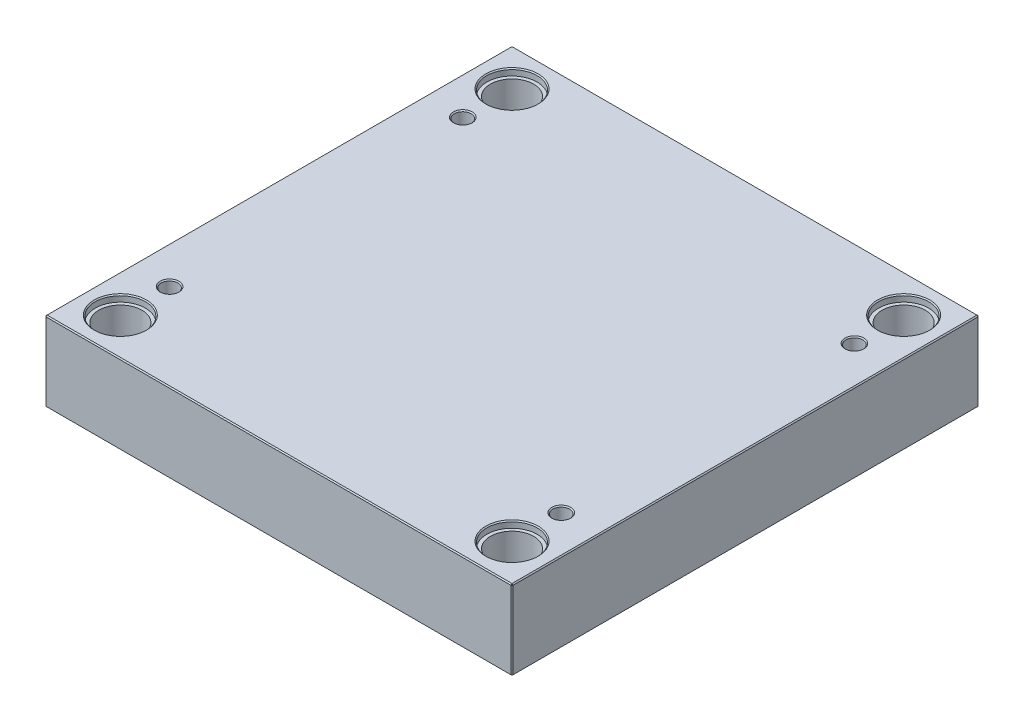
ISO-10303-21;
HEADER;
FILE_DESCRIPTION(('STEP AP214'),'2;1');
FILE_NAME('part.step','',(''),(''),'','','');
FILE_SCHEMA(('AUTOMOTIVE_DESIGN { 1 0 10303 214 1 1 1 1 }'));
ENDSEC;
DATA;
#1=APPLICATION_CONTEXT('core data for automotive mechanical design processes');
#2=APPLICATION_PROTOCOL_DEFINITION('international standard','automotive_design',2000,#1);
#3=PRODUCT_CONTEXT('',#1,'mechanical');
#4=PRODUCT('Part','Part','',(#3));
#5=PRODUCT_RELATED_PRODUCT_CATEGORY('part','',(#4));
#6=PRODUCT_DEFINITION_FORMATION('','',#4);
#7=PRODUCT_DEFINITION_CONTEXT('part definition',#1,'design');
#8=PRODUCT_DEFINITION('design','',#6,#7);
#9=PRODUCT_DEFINITION_SHAPE('','',#8);
#10=(LENGTH_UNIT() NAMED_UNIT(*) SI_UNIT(.MILLI.,.METRE.));
#11=(NAMED_UNIT(*) PLANE_ANGLE_UNIT() SI_UNIT($,.RADIAN.));
#12=(NAMED_UNIT(*) SI_UNIT($,.STERADIAN.) SOLID_ANGLE_UNIT());
#13=UNCERTAINTY_MEASURE_WITH_UNIT(LENGTH_MEASURE(1.E-05),#10,'distance_accuracy_value','');
#14=(GEOMETRIC_REPRESENTATION_CONTEXT(3) GLOBAL_UNCERTAINTY_ASSIGNED_CONTEXT((#13)) GLOBAL_UNIT_ASSIGNED_CONTEXT((#10,
#11,#12)) REPRESENTATION_CONTEXT('',''));
#15=CARTESIAN_POINT('',(0.,0.,0.));
#16=DIRECTION('',(0.,0.,1.));
#17=DIRECTION('',(1.,0.,0.));
#18=AXIS2_PLACEMENT_3D('',#15,#16,#17);
#19=CARTESIAN_POINT('',(-187.,0.,-187.));
#20=DIRECTION('',(0.,1.,0.));
#21=DIRECTION('',(0.,0.,1.));
#22=AXIS2_PLACEMENT_3D('',#19,#20,#21);
#23=CYLINDRICAL_SURFACE('',#22,20.65);
#24=CARTESIAN_POINT('',(-187.,0.999999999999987,-187.));
#25=DIRECTION('',(0.,1.,0.));
#26=DIRECTION('',(0.,0.,1.));
#27=AXIS2_PLACEMENT_3D('',#24,#25,#26);
#28=CIRCLE('',#27,20.65);
#29=CARTESIAN_POINT('',(-187.,0.999999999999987,-166.35));
#30=VERTEX_POINT('',#29);
#31=EDGE_CURVE('E471',#30,#30,#28,.F.);
#32=ORIENTED_EDGE('',*,*,#31,.T.);
#33=EDGE_LOOP('',(#32));
#34=FACE_BOUND('',#33,.T.);
#35=CARTESIAN_POINT('',(-187.,69.7,-187.));
#36=DIRECTION('',(0.,1.,0.));
#37=DIRECTION('',(0.,0.,1.));
#38=AXIS2_PLACEMENT_3D('',#35,#36,#37);
#39=CIRCLE('',#38,20.65);
#40=CARTESIAN_POINT('',(-187.,69.7,-166.35));
#41=VERTEX_POINT('',#40);
#42=EDGE_CURVE('E220',#41,#41,#39,.F.);
#43=ORIENTED_EDGE('',*,*,#42,.F.);
#44=EDGE_LOOP('',(#43));
#45=FACE_BOUND('',#44,.T.);
#46=ADVANCED_FACE('F15',(#34,#45),#23,.F.);
#47=CARTESIAN_POINT('',(187.,0.,-187.));
#48=DIRECTION('',(0.,1.,0.));
#49=DIRECTION('',(0.,0.,1.));
#50=AXIS2_PLACEMENT_3D('',#47,#48,#49);
#51=CYLINDRICAL_SURFACE('',#50,20.65);
#52=CARTESIAN_POINT('',(187.,0.999999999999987,-187.));
#53=DIRECTION('',(0.,1.,0.));
#54=DIRECTION('',(0.,0.,1.));
#55=AXIS2_PLACEMENT_3D('',#52,#53,#54);
#56=CIRCLE('',#55,20.65);
#57=CARTESIAN_POINT('',(187.,0.999999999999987,-166.35));
#58=VERTEX_POINT('',#57);
#59=EDGE_CURVE('E473',#58,#58,#56,.F.);
#60=ORIENTED_EDGE('',*,*,#59,.T.);
#61=EDGE_LOOP('',(#60));
#62=FACE_BOUND('',#61,.T.);
#63=CARTESIAN_POINT('',(187.,69.7,-187.));
#64=DIRECTION('',(0.,1.,0.));
#65=DIRECTION('',(0.,0.,1.));
#66=AXIS2_PLACEMENT_3D('',#63,#64,#65);
#67=CIRCLE('',#66,20.65);
#68=CARTESIAN_POINT('',(187.,69.7,-166.35));
#69=VERTEX_POINT('',#68);
#70=EDGE_CURVE('E217',#69,#69,#67,.F.);
#71=ORIENTED_EDGE('',*,*,#70,.F.);
#72=EDGE_LOOP('',(#71));
#73=FACE_BOUND('',#72,.T.);
#74=ADVANCED_FACE('F262',(#62,#73),#51,.F.);
#75=CARTESIAN_POINT('',(187.,0.,187.));
#76=DIRECTION('',(0.,1.,0.));
#77=DIRECTION('',(0.,0.,1.));
#78=AXIS2_PLACEMENT_3D('',#75,#76,#77);
#79=CYLINDRICAL_SURFACE('',#78,20.65);
#80=CARTESIAN_POINT('',(187.,0.999999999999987,187.));
#81=DIRECTION('',(0.,1.,0.));
#82=DIRECTION('',(0.,0.,1.));
#83=AXIS2_PLACEMENT_3D('',#80,#81,#82);
#84=CIRCLE('',#83,20.65);
#85=CARTESIAN_POINT('',(187.,0.999999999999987,207.65));
#86=VERTEX_POINT('',#85);
#87=EDGE_CURVE('E476',#86,#86,#84,.F.);
#88=ORIENTED_EDGE('',*,*,#87,.T.);
#89=EDGE_LOOP('',(#88));
#90=FACE_BOUND('',#89,.T.);
#91=CARTESIAN_POINT('',(187.,69.7,187.));
#92=DIRECTION('',(0.,1.,0.));
#93=DIRECTION('',(0.,0.,1.));
#94=AXIS2_PLACEMENT_3D('',#91,#92,#93);
#95=CIRCLE('',#94,20.65);
#96=CARTESIAN_POINT('',(187.,69.7,207.65));
#97=VERTEX_POINT('',#96);
#98=EDGE_CURVE('E213',#97,#97,#95,.F.);
#99=ORIENTED_EDGE('',*,*,#98,.F.);
#100=EDGE_LOOP('',(#99));
#101=FACE_BOUND('',#100,.T.);
#102=ADVANCED_FACE('F269',(#90,#101),#79,.F.);
#103=CARTESIAN_POINT('',(-187.,0.,187.));
#104=DIRECTION('',(0.,1.,0.));
#105=DIRECTION('',(0.,0.,1.));
#106=AXIS2_PLACEMENT_3D('',#103,#104,#105);
#107=CYLINDRICAL_SURFACE('',#106,20.65);
#108=CARTESIAN_POINT('',(-187.,0.999999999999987,187.));
#109=DIRECTION('',(0.,1.,0.));
#110=DIRECTION('',(0.,0.,1.));
#111=AXIS2_PLACEMENT_3D('',#108,#109,#110);
#112=CIRCLE('',#111,20.65);
#113=CARTESIAN_POINT('',(-187.,0.999999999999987,207.65));
#114=VERTEX_POINT('',#113);
#115=EDGE_CURVE('E479',#114,#114,#112,.F.);
#116=ORIENTED_EDGE('',*,*,#115,.T.);
#117=EDGE_LOOP('',(#116));
#118=FACE_BOUND('',#117,.T.);
#119=CARTESIAN_POINT('',(-187.,69.7,187.));
#120=DIRECTION('',(0.,1.,0.));
#121=DIRECTION('',(0.,0.,1.));
#122=AXIS2_PLACEMENT_3D('',#119,#120,#121);
#123=CIRCLE('',#122,20.65);
#124=CARTESIAN_POINT('',(-187.,69.7,207.65));
#125=VERTEX_POINT('',#124);
#126=EDGE_CURVE('E210',#125,#125,#123,.F.);
#127=ORIENTED_EDGE('',*,*,#126,.F.);
#128=EDGE_LOOP('',(#127));
#129=FACE_BOUND('',#128,.T.);
#130=ADVANCED_FACE('F276',(#118,#129),#107,.F.);
#131=CARTESIAN_POINT('',(-223.,76.,223.));
#132=DIRECTION('',(1.,0.,0.));
#133=DIRECTION('',(0.,0.,-1.));
#134=AXIS2_PLACEMENT_3D('',#131,#132,#133);
#135=PLANE('',#134);
#136=DIRECTION('',(0.,-1.,0.));
#137=VECTOR('',#136,1.);
#138=CARTESIAN_POINT('',(-223.,76.,-222.));
#139=LINE('',#138,#137);
#140=CARTESIAN_POINT('',(-223.,75.,-222.));
#141=VERTEX_POINT('',#140);
#142=CARTESIAN_POINT('',(-223.,1.,-222.));
#143=VERTEX_POINT('',#142);
#144=EDGE_CURVE('E486',#141,#143,#139,.T.);
#145=ORIENTED_EDGE('',*,*,#144,.T.);
#146=DIRECTION('',(0.,0.,1.));
#147=VECTOR('',#146,1.);
#148=CARTESIAN_POINT('',(-223.,1.,223.));
#149=LINE('',#148,#147);
#150=CARTESIAN_POINT('',(-223.,1.,222.));
#151=VERTEX_POINT('',#150);
#152=EDGE_CURVE('E489',#143,#151,#149,.T.);
#153=ORIENTED_EDGE('',*,*,#152,.T.);
#154=DIRECTION('',(0.,1.,0.));
#155=VECTOR('',#154,1.);
#156=CARTESIAN_POINT('',(-223.,76.,222.));
#157=LINE('',#156,#155);
#158=CARTESIAN_POINT('',(-223.,75.,222.));
#159=VERTEX_POINT('',#158);
#160=EDGE_CURVE('E484',#151,#159,#157,.T.);
#161=ORIENTED_EDGE('',*,*,#160,.T.);
#162=DIRECTION('',(0.,0.,-1.));
#163=VECTOR('',#162,1.);
#164=CARTESIAN_POINT('',(-223.,75.,-223.));
#165=LINE('',#164,#163);
#166=EDGE_CURVE('E482',#159,#141,#165,.T.);
#167=ORIENTED_EDGE('',*,*,#166,.T.);
#168=EDGE_LOOP('',(#145,#153,#161,#167));
#169=FACE_BOUND('',#168,.T.);
#170=ADVANCED_FACE('F297',(#169),#135,.F.);
#171=CARTESIAN_POINT('',(223.,76.,223.));
#172=DIRECTION('',(0.,0.,-1.));
#173=DIRECTION('',(-1.,0.,0.));
#174=AXIS2_PLACEMENT_3D('',#171,#172,#173);
#175=PLANE('',#174);
#176=DIRECTION('',(-1.,0.,0.));
#177=VECTOR('',#176,1.);
#178=CARTESIAN_POINT('',(-223.,75.,223.));
#179=LINE('',#178,#177);
#180=CARTESIAN_POINT('',(222.,75.,223.));
#181=VERTEX_POINT('',#180);
#182=CARTESIAN_POINT('',(-222.,75.,223.));
#183=VERTEX_POINT('',#182);
#184=EDGE_CURVE('E508',#181,#183,#179,.T.);
#185=ORIENTED_EDGE('',*,*,#184,.T.);
#186=DIRECTION('',(0.,-1.,0.));
#187=VECTOR('',#186,1.);
#188=CARTESIAN_POINT('',(-222.,76.,223.));
#189=LINE('',#188,#187);
#190=CARTESIAN_POINT('',(-222.,1.00000000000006,223.));
#191=VERTEX_POINT('',#190);
#192=EDGE_CURVE('E514',#183,#191,#189,.T.);
#193=ORIENTED_EDGE('',*,*,#192,.T.);
#194=DIRECTION('',(1.,0.,0.));
#195=VECTOR('',#194,1.);
#196=CARTESIAN_POINT('',(223.,1.00000000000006,223.));
#197=LINE('',#196,#195);
#198=CARTESIAN_POINT('',(222.,1.00000000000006,223.));
#199=VERTEX_POINT('',#198);
#200=EDGE_CURVE('E512',#191,#199,#197,.T.);
#201=ORIENTED_EDGE('',*,*,#200,.T.);
#202=DIRECTION('',(0.,1.,0.));
#203=VECTOR('',#202,1.);
#204=CARTESIAN_POINT('',(222.,76.,223.));
#205=LINE('',#204,#203);
#206=EDGE_CURVE('E510',#199,#181,#205,.T.);
#207=ORIENTED_EDGE('',*,*,#206,.T.);
#208=EDGE_LOOP('',(#185,#193,#201,#207));
#209=FACE_BOUND('',#208,.T.);
#210=ADVANCED_FACE('F293',(#209),#175,.F.);
#211=CARTESIAN_POINT('',(223.,76.,223.));
#212=DIRECTION('',(-1.,0.,0.));
#213=DIRECTION('',(0.,0.,1.));
#214=AXIS2_PLACEMENT_3D('',#211,#212,#213);
#215=PLANE('',#214);
#216=DIRECTION('',(0.,0.,-1.));
#217=VECTOR('',#216,1.);
#218=CARTESIAN_POINT('',(223.,1.00000000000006,223.));
#219=LINE('',#218,#217);
#220=CARTESIAN_POINT('',(223.,1.00000000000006,222.));
#221=VERTEX_POINT('',#220);
#222=CARTESIAN_POINT('',(223.,1.00000000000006,-222.));
#223=VERTEX_POINT('',#222);
#224=EDGE_CURVE('E503',#221,#223,#219,.T.);
#225=ORIENTED_EDGE('',*,*,#224,.T.);
#226=DIRECTION('',(0.,1.,0.));
#227=VECTOR('',#226,1.);
#228=CARTESIAN_POINT('',(223.,76.,-222.));
#229=LINE('',#228,#227);
#230=CARTESIAN_POINT('',(223.,75.,-222.));
#231=VERTEX_POINT('',#230);
#232=EDGE_CURVE('E505',#223,#231,#229,.T.);
#233=ORIENTED_EDGE('',*,*,#232,.T.);
#234=DIRECTION('',(0.,0.,1.));
#235=VECTOR('',#234,1.);
#236=CARTESIAN_POINT('',(223.,75.,223.));
#237=LINE('',#236,#235);
#238=CARTESIAN_POINT('',(223.,75.,222.));
#239=VERTEX_POINT('',#238);
#240=EDGE_CURVE('E499',#231,#239,#237,.T.);
#241=ORIENTED_EDGE('',*,*,#240,.T.);
#242=DIRECTION('',(0.,-1.,0.));
#243=VECTOR('',#242,1.);
#244=CARTESIAN_POINT('',(223.,76.,222.));
#245=LINE('',#244,#243);
#246=EDGE_CURVE('E501',#239,#221,#245,.T.);
#247=ORIENTED_EDGE('',*,*,#246,.T.);
#248=EDGE_LOOP('',(#225,#233,#241,#247));
#249=FACE_BOUND('',#248,.T.);
#250=ADVANCED_FACE('F289',(#249),#215,.F.);
#251=CARTESIAN_POINT('',(223.,76.,-223.));
#252=DIRECTION('',(0.,0.,1.));
#253=DIRECTION('',(1.,0.,0.));
#254=AXIS2_PLACEMENT_3D('',#251,#252,#253);
#255=PLANE('',#254);
#256=DIRECTION('',(0.,-1.,0.));
#257=VECTOR('',#256,1.);
#258=CARTESIAN_POINT('',(222.,76.,-223.));
#259=LINE('',#258,#257);
#260=CARTESIAN_POINT('',(222.,75.,-223.));
#261=VERTEX_POINT('',#260);
#262=CARTESIAN_POINT('',(222.,1.00000000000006,-223.));
#263=VERTEX_POINT('',#262);
#264=EDGE_CURVE('E493',#261,#263,#259,.T.);
#265=ORIENTED_EDGE('',*,*,#264,.T.);
#266=DIRECTION('',(-1.,0.,0.));
#267=VECTOR('',#266,1.);
#268=CARTESIAN_POINT('',(223.,1.00000000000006,-223.));
#269=LINE('',#268,#267);
#270=CARTESIAN_POINT('',(-222.,1.00000000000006,-223.));
#271=VERTEX_POINT('',#270);
#272=EDGE_CURVE('E137',#263,#271,#269,.T.);
#273=ORIENTED_EDGE('',*,*,#272,.T.);
#274=DIRECTION('',(0.,1.,0.));
#275=VECTOR('',#274,1.);
#276=CARTESIAN_POINT('',(-222.,76.,-223.));
#277=LINE('',#276,#275);
#278=CARTESIAN_POINT('',(-222.,75.,-223.));
#279=VERTEX_POINT('',#278);
#280=EDGE_CURVE('E495',#271,#279,#277,.T.);
#281=ORIENTED_EDGE('',*,*,#280,.T.);
#282=DIRECTION('',(1.,0.,0.));
#283=VECTOR('',#282,1.);
#284=CARTESIAN_POINT('',(223.,75.,-223.));
#285=LINE('',#284,#283);
#286=EDGE_CURVE('E491',#279,#261,#285,.T.);
#287=ORIENTED_EDGE('',*,*,#286,.T.);
#288=EDGE_LOOP('',(#265,#273,#281,#287));
#289=FACE_BOUND('',#288,.T.);
#290=ADVANCED_FACE('F281',(#289),#255,.F.);
#291=CARTESIAN_POINT('',(0.,76.,0.));
#292=DIRECTION('',(0.,1.,0.));
#293=DIRECTION('',(0.,0.,1.));
#294=AXIS2_PLACEMENT_3D('',#291,#292,#293);
#295=PLANE('',#294);
#296=CARTESIAN_POINT('',(187.,76.,187.));
#297=DIRECTION('',(0.,1.,0.));
#298=DIRECTION('',(0.,0.,1.));
#299=AXIS2_PLACEMENT_3D('',#296,#297,#298);
#300=CIRCLE('',#299,25.);
#301=CARTESIAN_POINT('',(187.,76.,212.));
#302=VERTEX_POINT('',#301);
#303=EDGE_CURVE('E235',#302,#302,#300,.F.);
#304=ORIENTED_EDGE('',*,*,#303,.T.);
#305=EDGE_LOOP('',(#304));
#306=FACE_BOUND('',#305,.T.);
#307=CARTESIAN_POINT('',(-187.,76.,187.));
#308=DIRECTION('',(0.,1.,0.));
#309=DIRECTION('',(0.,0.,1.));
#310=AXIS2_PLACEMENT_3D('',#307,#308,#309);
#311=CIRCLE('',#310,25.);
#312=CARTESIAN_POINT('',(-187.,76.,212.));
#313=VERTEX_POINT('',#312);
#314=EDGE_CURVE('E232',#313,#313,#311,.F.);
#315=ORIENTED_EDGE('',*,*,#314,.T.);
#316=EDGE_LOOP('',(#315));
#317=FACE_BOUND('',#316,.T.);
#318=CARTESIAN_POINT('',(187.,76.,-187.));
#319=DIRECTION('',(0.,1.,0.));
#320=DIRECTION('',(0.,0.,1.));
#321=AXIS2_PLACEMENT_3D('',#318,#319,#320);
#322=CIRCLE('',#321,25.);
#323=CARTESIAN_POINT('',(187.,76.,-162.));
#324=VERTEX_POINT('',#323);
#325=EDGE_CURVE('E229',#324,#324,#322,.F.);
#326=ORIENTED_EDGE('',*,*,#325,.T.);
#327=EDGE_LOOP('',(#326));
#328=FACE_BOUND('',#327,.T.);
#329=CARTESIAN_POINT('',(-187.,76.,-187.));
#330=DIRECTION('',(0.,1.,0.));
#331=DIRECTION('',(0.,0.,1.));
#332=AXIS2_PLACEMENT_3D('',#329,#330,#331);
#333=CIRCLE('',#332,25.);
#334=CARTESIAN_POINT('',(-187.,76.,-162.));
#335=VERTEX_POINT('',#334);
#336=EDGE_CURVE('E226',#335,#335,#333,.F.);
#337=ORIENTED_EDGE('',*,*,#336,.T.);
#338=EDGE_LOOP('',(#337));
#339=FACE_BOUND('',#338,.T.);
#340=CARTESIAN_POINT('',(-187.,76.,140.));
#341=DIRECTION('',(0.,1.,0.));
#342=DIRECTION('',(0.,0.,1.));
#343=AXIS2_PLACEMENT_3D('',#340,#341,#342);
#344=CIRCLE('',#343,8.9999999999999);
#345=CARTESIAN_POINT('',(-187.,76.,149.));
#346=VERTEX_POINT('',#345);
#347=EDGE_CURVE('E197',#346,#346,#344,.F.);
#348=ORIENTED_EDGE('',*,*,#347,.T.);
#349=EDGE_LOOP('',(#348));
#350=FACE_BOUND('',#349,.T.);
#351=CARTESIAN_POINT('',(187.,76.,140.));
#352=DIRECTION('',(0.,1.,0.));
#353=DIRECTION('',(0.,0.,1.));
#354=AXIS2_PLACEMENT_3D('',#351,#352,#353);
#355=CIRCLE('',#354,9.00000000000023);
#356=CARTESIAN_POINT('',(187.,76.,149.));
#357=VERTEX_POINT('',#356);
#358=EDGE_CURVE('E194',#357,#357,#355,.F.);
#359=ORIENTED_EDGE('',*,*,#358,.T.);
#360=EDGE_LOOP('',(#359));
#361=FACE_BOUND('',#360,.T.);
#362=CARTESIAN_POINT('',(187.,76.,-140.));
#363=DIRECTION('',(0.,1.,0.));
#364=DIRECTION('',(0.,0.,1.));
#365=AXIS2_PLACEMENT_3D('',#362,#363,#364);
#366=CIRCLE('',#365,9.);
#367=CARTESIAN_POINT('',(187.,76.,-131.));
#368=VERTEX_POINT('',#367);
#369=EDGE_CURVE('E191',#368,#368,#366,.F.);
#370=ORIENTED_EDGE('',*,*,#369,.T.);
#371=EDGE_LOOP('',(#370));
#372=FACE_BOUND('',#371,.T.);
#373=CARTESIAN_POINT('',(-187.,76.,-140.));
#374=DIRECTION('',(0.,1.,0.));
#375=DIRECTION('',(0.,0.,1.));
#376=AXIS2_PLACEMENT_3D('',#373,#374,#375);
#377=CIRCLE('',#376,8.9999999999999);
#378=CARTESIAN_POINT('',(-187.,76.,-131.));
#379=VERTEX_POINT('',#378);
#380=EDGE_CURVE('E187',#379,#379,#377,.F.);
#381=ORIENTED_EDGE('',*,*,#380,.T.);
#382=EDGE_LOOP('',(#381));
#383=FACE_BOUND('',#382,.T.);
#384=DIRECTION('',(0.,0.,-1.));
#385=VECTOR('',#384,1.);
#386=CARTESIAN_POINT('',(222.,76.,-223.));
#387=LINE('',#386,#385);
#388=CARTESIAN_POINT('',(222.,76.,222.));
#389=VERTEX_POINT('',#388);
#390=CARTESIAN_POINT('',(222.,76.,-222.));
#391=VERTEX_POINT('',#390);
#392=EDGE_CURVE('E30',#389,#391,#387,.T.);
#393=ORIENTED_EDGE('',*,*,#392,.T.);
#394=DIRECTION('',(-1.,0.,0.));
#395=VECTOR('',#394,1.);
#396=CARTESIAN_POINT('',(-223.,76.,-222.));
#397=LINE('',#396,#395);
#398=CARTESIAN_POINT('',(-222.,76.,-222.));
#399=VERTEX_POINT('',#398);
#400=EDGE_CURVE('E188',#391,#399,#397,.T.);
#401=ORIENTED_EDGE('',*,*,#400,.T.);
#402=DIRECTION('',(0.,0.,1.));
#403=VECTOR('',#402,1.);
#404=CARTESIAN_POINT('',(-222.,76.,223.));
#405=LINE('',#404,#403);
#406=CARTESIAN_POINT('',(-222.,76.,222.));
#407=VERTEX_POINT('',#406);
#408=EDGE_CURVE('E517',#399,#407,#405,.T.);
#409=ORIENTED_EDGE('',*,*,#408,.T.);
#410=DIRECTION('',(1.,0.,0.));
#411=VECTOR('',#410,1.);
#412=CARTESIAN_POINT('',(223.,76.,222.));
#413=LINE('',#412,#411);
#414=EDGE_CURVE('E35',#407,#389,#413,.T.);
#415=ORIENTED_EDGE('',*,*,#414,.T.);
#416=EDGE_LOOP('',(#393,#401,#409,#415));
#417=FACE_BOUND('',#416,.T.);
#418=ADVANCED_FACE('F278',(#306,#317,#328,#339,#350,#361,#372,#383,#417),#295,.T.);
#419=CARTESIAN_POINT('',(0.,0.,0.));
#420=DIRECTION('',(0.,1.,0.));
#421=DIRECTION('',(0.,0.,1.));
#422=AXIS2_PLACEMENT_3D('',#419,#420,#421);
#423=PLANE('',#422);
#424=CARTESIAN_POINT('',(-187.,0.,-187.));
#425=DIRECTION('',(0.,1.,0.));
#426=DIRECTION('',(0.,0.,1.));
#427=AXIS2_PLACEMENT_3D('',#424,#425,#426);
#428=CIRCLE('',#427,21.65);
#429=CARTESIAN_POINT('',(-187.,0.,-165.35));
#430=VERTEX_POINT('',#429);
#431=EDGE_CURVE('E468',#430,#430,#428,.T.);
#432=ORIENTED_EDGE('',*,*,#431,.T.);
#433=EDGE_LOOP('',(#432));
#434=FACE_BOUND('',#433,.T.);
#435=CARTESIAN_POINT('',(187.,0.,-187.));
#436=DIRECTION('',(0.,1.,0.));
#437=DIRECTION('',(0.,0.,1.));
#438=AXIS2_PLACEMENT_3D('',#435,#436,#437);
#439=CIRCLE('',#438,21.65);
#440=CARTESIAN_POINT('',(187.,0.,-165.35));
#441=VERTEX_POINT('',#440);
#442=EDGE_CURVE('E465',#441,#441,#439,.T.);
#443=ORIENTED_EDGE('',*,*,#442,.T.);
#444=EDGE_LOOP('',(#443));
#445=FACE_BOUND('',#444,.T.);
#446=CARTESIAN_POINT('',(187.,0.,187.));
#447=DIRECTION('',(0.,1.,0.));
#448=DIRECTION('',(0.,0.,1.));
#449=AXIS2_PLACEMENT_3D('',#446,#447,#448);
#450=CIRCLE('',#449,21.65);
#451=CARTESIAN_POINT('',(187.,0.,208.65));
#452=VERTEX_POINT('',#451);
#453=EDGE_CURVE('E462',#452,#452,#450,.T.);
#454=ORIENTED_EDGE('',*,*,#453,.T.);
#455=EDGE_LOOP('',(#454));
#456=FACE_BOUND('',#455,.T.);
#457=CARTESIAN_POINT('',(-187.,0.,187.));
#458=DIRECTION('',(0.,1.,0.));
#459=DIRECTION('',(0.,0.,1.));
#460=AXIS2_PLACEMENT_3D('',#457,#458,#459);
#461=CIRCLE('',#460,21.65);
#462=CARTESIAN_POINT('',(-187.,0.,208.65));
#463=VERTEX_POINT('',#462);
#464=EDGE_CURVE('E459',#463,#463,#461,.T.);
#465=ORIENTED_EDGE('',*,*,#464,.T.);
#466=EDGE_LOOP('',(#465));
#467=FACE_BOUND('',#466,.T.);
#468=DIRECTION('',(0.,0.,1.));
#469=VECTOR('',#468,1.);
#470=CARTESIAN_POINT('',(222.,0.,0.));
#471=LINE('',#470,#469);
#472=CARTESIAN_POINT('',(222.,0.,-222.));
#473=VERTEX_POINT('',#472);
#474=CARTESIAN_POINT('',(222.,0.,222.));
#475=VERTEX_POINT('',#474);
#476=EDGE_CURVE('E107',#473,#475,#471,.T.);
#477=ORIENTED_EDGE('',*,*,#476,.T.);
#478=DIRECTION('',(-1.,0.,0.));
#479=VECTOR('',#478,1.);
#480=CARTESIAN_POINT('',(0.,0.,222.));
#481=LINE('',#480,#479);
#482=CARTESIAN_POINT('',(-222.,0.,222.));
#483=VERTEX_POINT('',#482);
#484=EDGE_CURVE('E457',#475,#483,#481,.T.);
#485=ORIENTED_EDGE('',*,*,#484,.T.);
#486=DIRECTION('',(0.,0.,-1.));
#487=VECTOR('',#486,1.);
#488=CARTESIAN_POINT('',(-222.,0.,0.));
#489=LINE('',#488,#487);
#490=CARTESIAN_POINT('',(-222.,0.,-222.));
#491=VERTEX_POINT('',#490);
#492=EDGE_CURVE('E109',#483,#491,#489,.T.);
#493=ORIENTED_EDGE('',*,*,#492,.T.);
#494=DIRECTION('',(1.,0.,0.));
#495=VECTOR('',#494,1.);
#496=CARTESIAN_POINT('',(0.,0.,-222.));
#497=LINE('',#496,#495);
#498=EDGE_CURVE('E103',#491,#473,#497,.T.);
#499=ORIENTED_EDGE('',*,*,#498,.T.);
#500=EDGE_LOOP('',(#477,#485,#493,#499));
#501=FACE_BOUND('',#500,.T.);
#502=ADVANCED_FACE('F105',(#434,#445,#456,#467,#501),#423,.F.);
#503=CARTESIAN_POINT('',(-187.,0.,-187.));
#504=DIRECTION('',(0.,-1.,0.));
#505=DIRECTION('',(0.,0.,-1.));
#506=AXIS2_PLACEMENT_3D('',#503,#504,#505);
#507=CONICAL_SURFACE('',#506,21.65,0.785398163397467);
#508=ORIENTED_EDGE('',*,*,#31,.F.);
#509=EDGE_LOOP('',(#508));
#510=FACE_BOUND('',#509,.T.);
#511=ORIENTED_EDGE('',*,*,#431,.F.);
#512=EDGE_LOOP('',(#511));
#513=FACE_BOUND('',#512,.T.);
#514=ADVANCED_FACE('F285',(#510,#513),#507,.F.);
#515=CARTESIAN_POINT('',(187.,0.,-187.));
#516=DIRECTION('',(0.,-1.,0.));
#517=DIRECTION('',(0.,0.,-1.));
#518=AXIS2_PLACEMENT_3D('',#515,#516,#517);
#519=CONICAL_SURFACE('',#518,21.65,0.785398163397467);
#520=ORIENTED_EDGE('',*,*,#59,.F.);
#521=EDGE_LOOP('',(#520));
#522=FACE_BOUND('',#521,.T.);
#523=ORIENTED_EDGE('',*,*,#442,.F.);
#524=EDGE_LOOP('',(#523));
#525=FACE_BOUND('',#524,.T.);
#526=ADVANCED_FACE('F304',(#522,#525),#519,.F.);
#527=CARTESIAN_POINT('',(187.,0.,187.));
#528=DIRECTION('',(0.,-1.,0.));
#529=DIRECTION('',(0.,0.,-1.));
#530=AXIS2_PLACEMENT_3D('',#527,#528,#529);
#531=CONICAL_SURFACE('',#530,21.65,0.785398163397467);
#532=ORIENTED_EDGE('',*,*,#87,.F.);
#533=EDGE_LOOP('',(#532));
#534=FACE_BOUND('',#533,.T.);
#535=ORIENTED_EDGE('',*,*,#453,.F.);
#536=EDGE_LOOP('',(#535));
#537=FACE_BOUND('',#536,.T.);
#538=ADVANCED_FACE('F308',(#534,#537),#531,.F.);
#539=CARTESIAN_POINT('',(-187.,0.,187.));
#540=DIRECTION('',(0.,-1.,0.));
#541=DIRECTION('',(0.,0.,-1.));
#542=AXIS2_PLACEMENT_3D('',#539,#540,#541);
#543=CONICAL_SURFACE('',#542,21.65,0.785398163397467);
#544=ORIENTED_EDGE('',*,*,#115,.F.);
#545=EDGE_LOOP('',(#544));
#546=FACE_BOUND('',#545,.T.);
#547=ORIENTED_EDGE('',*,*,#464,.F.);
#548=EDGE_LOOP('',(#547));
#549=FACE_BOUND('',#548,.T.);
#550=ADVANCED_FACE('F312',(#546,#549),#543,.F.);
#551=CARTESIAN_POINT('',(223.,76.,222.));
#552=DIRECTION('',(-0.707106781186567,0.,-0.707106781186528));
#553=DIRECTION('',(0.,-1.,0.));
#554=AXIS2_PLACEMENT_3D('',#551,#552,#553);
#555=PLANE('',#554);
#556=DIRECTION('',(-0.707106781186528,0.,0.707106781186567));
#557=VECTOR('',#556,1.);
#558=CARTESIAN_POINT('',(222.,75.,223.));
#559=LINE('',#558,#557);
#560=EDGE_CURVE('E125',#181,#239,#559,.F.);
#561=ORIENTED_EDGE('',*,*,#560,.F.);
#562=ORIENTED_EDGE('',*,*,#206,.F.);
#563=DIRECTION('',(0.707106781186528,0.,-0.707106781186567));
#564=VECTOR('',#563,1.);
#565=CARTESIAN_POINT('',(222.,1.00000000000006,223.));
#566=LINE('',#565,#564);
#567=EDGE_CURVE('E179',#221,#199,#566,.F.);
#568=ORIENTED_EDGE('',*,*,#567,.F.);
#569=ORIENTED_EDGE('',*,*,#246,.F.);
#570=EDGE_LOOP('',(#561,#562,#568,#569));
#571=FACE_BOUND('',#570,.T.);
#572=ADVANCED_FACE('F316',(#571),#555,.F.);
#573=CARTESIAN_POINT('',(222.,75.,223.));
#574=DIRECTION('',(0.577350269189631,0.577350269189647,0.577350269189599));
#575=DIRECTION('',(-0.707106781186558,0.707106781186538,0.));
#576=AXIS2_PLACEMENT_3D('',#573,#574,#575);
#577=PLANE('',#576);
#578=DIRECTION('',(0.,-0.707106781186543,0.707106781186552));
#579=VECTOR('',#578,1.);
#580=CARTESIAN_POINT('',(222.,75.,223.));
#581=LINE('',#580,#579);
#582=EDGE_CURVE('E174',#181,#389,#581,.F.);
#583=ORIENTED_EDGE('',*,*,#582,.F.);
#584=ORIENTED_EDGE('',*,*,#560,.T.);
#585=DIRECTION('',(-0.707106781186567,0.707106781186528,0.));
#586=VECTOR('',#585,1.);
#587=CARTESIAN_POINT('',(222.5,75.5,222.));
#588=LINE('',#587,#586);
#589=EDGE_CURVE('E176',#389,#239,#588,.F.);
#590=ORIENTED_EDGE('',*,*,#589,.F.);
#591=EDGE_LOOP('',(#583,#584,#590));
#592=FACE_BOUND('',#591,.T.);
#593=ADVANCED_FACE('F384',(#592),#577,.T.);
#594=CARTESIAN_POINT('',(222.,1.00000000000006,223.));
#595=DIRECTION('',(0.577350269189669,-0.577350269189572,0.577350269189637));
#596=DIRECTION('',(0.707106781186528,0.,-0.707106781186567));
#597=AXIS2_PLACEMENT_3D('',#594,#595,#596);
#598=PLANE('',#597);
#599=DIRECTION('',(-0.707106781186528,-0.707106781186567,0.));
#600=VECTOR('',#599,1.);
#601=CARTESIAN_POINT('',(222.5,0.5,222.));
#602=LINE('',#601,#600);
#603=EDGE_CURVE('E123',#221,#475,#602,.T.);
#604=ORIENTED_EDGE('',*,*,#603,.F.);
#605=ORIENTED_EDGE('',*,*,#567,.T.);
#606=DIRECTION('',(0.,0.707106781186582,0.707106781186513));
#607=VECTOR('',#606,1.);
#608=CARTESIAN_POINT('',(222.,1.00000000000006,223.));
#609=LINE('',#608,#607);
#610=EDGE_CURVE('E171',#475,#199,#609,.T.);
#611=ORIENTED_EDGE('',*,*,#610,.F.);
#612=EDGE_LOOP('',(#604,#605,#611));
#613=FACE_BOUND('',#612,.T.);
#614=ADVANCED_FACE('F380',(#613),#598,.T.);
#615=CARTESIAN_POINT('',(222.,76.,0.));
#616=DIRECTION('',(0.707106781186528,0.707106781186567,0.));
#617=DIRECTION('',(0.,0.,1.));
#618=AXIS2_PLACEMENT_3D('',#615,#616,#617);
#619=PLANE('',#618);
#620=ORIENTED_EDGE('',*,*,#589,.T.);
#621=ORIENTED_EDGE('',*,*,#240,.F.);
#622=DIRECTION('',(0.707106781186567,-0.707106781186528,0.));
#623=VECTOR('',#622,1.);
#624=CARTESIAN_POINT('',(223.,75.,-222.));
#625=LINE('',#624,#623);
#626=EDGE_CURVE('E165',#391,#231,#625,.T.);
#627=ORIENTED_EDGE('',*,*,#626,.F.);
#628=ORIENTED_EDGE('',*,*,#392,.F.);
#629=EDGE_LOOP('',(#620,#621,#627,#628));
#630=FACE_BOUND('',#629,.T.);
#631=ADVANCED_FACE('F376',(#630),#619,.T.);
#632=CARTESIAN_POINT('',(0.,76.,222.));
#633=DIRECTION('',(0.,0.707106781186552,0.707106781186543));
#634=DIRECTION('',(-1.,0.,0.));
#635=AXIS2_PLACEMENT_3D('',#632,#633,#634);
#636=PLANE('',#635);
#637=ORIENTED_EDGE('',*,*,#582,.T.);
#638=ORIENTED_EDGE('',*,*,#414,.F.);
#639=DIRECTION('',(0.,0.707106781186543,-0.707106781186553));
#640=VECTOR('',#639,1.);
#641=CARTESIAN_POINT('',(-222.,75.5,222.5));
#642=LINE('',#641,#640);
#643=EDGE_CURVE('E162',#183,#407,#642,.T.);
#644=ORIENTED_EDGE('',*,*,#643,.F.);
#645=ORIENTED_EDGE('',*,*,#184,.F.);
#646=EDGE_LOOP('',(#637,#638,#644,#645));
#647=FACE_BOUND('',#646,.T.);
#648=ADVANCED_FACE('F372',(#647),#636,.T.);
#649=CARTESIAN_POINT('',(-222.,76.,223.));
#650=DIRECTION('',(0.707106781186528,0.,-0.707106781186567));
#651=DIRECTION('',(0.,-1.,0.));
#652=AXIS2_PLACEMENT_3D('',#649,#650,#651);
#653=PLANE('',#652);
#654=DIRECTION('',(0.707106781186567,0.,0.707106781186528));
#655=VECTOR('',#654,1.);
#656=CARTESIAN_POINT('',(-222.,1.00000000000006,223.));
#657=LINE('',#656,#655);
#658=EDGE_CURVE('E156',#191,#151,#657,.F.);
#659=ORIENTED_EDGE('',*,*,#658,.F.);
#660=ORIENTED_EDGE('',*,*,#192,.F.);
#661=DIRECTION('',(-0.707106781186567,0.,-0.707106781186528));
#662=VECTOR('',#661,1.);
#663=CARTESIAN_POINT('',(-223.,75.,222.));
#664=LINE('',#663,#662);
#665=EDGE_CURVE('E159',#159,#183,#664,.F.);
#666=ORIENTED_EDGE('',*,*,#665,.F.);
#667=ORIENTED_EDGE('',*,*,#160,.F.);
#668=EDGE_LOOP('',(#659,#660,#666,#667));
#669=FACE_BOUND('',#668,.T.);
#670=ADVANCED_FACE('F368',(#669),#653,.F.);
#671=CARTESIAN_POINT('',(223.,1.00000000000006,223.));
#672=DIRECTION('',(0.,0.707106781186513,-0.707106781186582));
#673=DIRECTION('',(1.,0.,0.));
#674=AXIS2_PLACEMENT_3D('',#671,#672,#673);
#675=PLANE('',#674);
#676=ORIENTED_EDGE('',*,*,#610,.T.);
#677=ORIENTED_EDGE('',*,*,#200,.F.);
#678=DIRECTION('',(0.,-0.707106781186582,-0.707106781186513));
#679=VECTOR('',#678,1.);
#680=CARTESIAN_POINT('',(-222.,1.00000000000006,223.));
#681=LINE('',#680,#679);
#682=EDGE_CURVE('E134',#483,#191,#681,.F.);
#683=ORIENTED_EDGE('',*,*,#682,.F.);
#684=ORIENTED_EDGE('',*,*,#484,.F.);
#685=EDGE_LOOP('',(#676,#677,#683,#684));
#686=FACE_BOUND('',#685,.T.);
#687=ADVANCED_FACE('F365',(#686),#675,.F.);
#688=CARTESIAN_POINT('',(223.,1.00000000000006,223.));
#689=DIRECTION('',(-0.707106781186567,0.707106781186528,0.));
#690=DIRECTION('',(0.,0.,-1.));
#691=AXIS2_PLACEMENT_3D('',#688,#689,#690);
#692=PLANE('',#691);
#693=ORIENTED_EDGE('',*,*,#603,.T.);
#694=ORIENTED_EDGE('',*,*,#476,.F.);
#695=DIRECTION('',(0.707106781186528,0.707106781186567,0.));
#696=VECTOR('',#695,1.);
#697=CARTESIAN_POINT('',(222.5,0.500000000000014,-222.));
#698=LINE('',#697,#696);
#699=EDGE_CURVE('E120',#223,#473,#698,.F.);
#700=ORIENTED_EDGE('',*,*,#699,.F.);
#701=ORIENTED_EDGE('',*,*,#224,.F.);
#702=EDGE_LOOP('',(#693,#694,#700,#701));
#703=FACE_BOUND('',#702,.T.);
#704=ADVANCED_FACE('F118',(#703),#692,.F.);
#705=CARTESIAN_POINT('',(222.,76.,-223.));
#706=DIRECTION('',(-0.707106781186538,0.,0.707106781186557));
#707=DIRECTION('',(0.,-1.,0.));
#708=AXIS2_PLACEMENT_3D('',#705,#706,#707);
#709=PLANE('',#708);
#710=DIRECTION('',(0.707106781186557,0.,0.707106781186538));
#711=VECTOR('',#710,1.);
#712=CARTESIAN_POINT('',(223.,75.,-222.));
#713=LINE('',#712,#711);
#714=EDGE_CURVE('E167',#231,#261,#713,.F.);
#715=ORIENTED_EDGE('',*,*,#714,.F.);
#716=ORIENTED_EDGE('',*,*,#232,.F.);
#717=DIRECTION('',(-0.707106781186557,0.,-0.707106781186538));
#718=VECTOR('',#717,1.);
#719=CARTESIAN_POINT('',(222.,1.00000000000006,-223.));
#720=LINE('',#719,#718);
#721=EDGE_CURVE('E133',#263,#223,#720,.F.);
#722=ORIENTED_EDGE('',*,*,#721,.F.);
#723=ORIENTED_EDGE('',*,*,#264,.F.);
#724=EDGE_LOOP('',(#715,#716,#722,#723));
#725=FACE_BOUND('',#724,.T.);
#726=ADVANCED_FACE('F358',(#725),#709,.F.);
#727=CARTESIAN_POINT('',(223.,75.,-222.));
#728=DIRECTION('',(0.577350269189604,0.577350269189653,-0.57735026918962));
#729=DIRECTION('',(0.,0.707106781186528,0.707106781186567));
#730=AXIS2_PLACEMENT_3D('',#727,#728,#729);
#731=PLANE('',#730);
#732=ORIENTED_EDGE('',*,*,#626,.T.);
#733=ORIENTED_EDGE('',*,*,#714,.T.);
#734=DIRECTION('',(0.,0.707106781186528,0.707106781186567));
#735=VECTOR('',#734,1.);
#736=CARTESIAN_POINT('',(222.,75.5,-222.5));
#737=LINE('',#736,#735);
#738=EDGE_CURVE('E151',#391,#261,#737,.F.);
#739=ORIENTED_EDGE('',*,*,#738,.F.);
#740=EDGE_LOOP('',(#732,#733,#739));
#741=FACE_BOUND('',#740,.T.);
#742=ADVANCED_FACE('F354',(#741),#731,.T.);
#743=CARTESIAN_POINT('',(-223.,75.,222.));
#744=DIRECTION('',(-0.577350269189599,0.577350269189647,0.577350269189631));
#745=DIRECTION('',(0.,-0.707106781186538,0.707106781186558));
#746=AXIS2_PLACEMENT_3D('',#743,#744,#745);
#747=PLANE('',#746);
#748=ORIENTED_EDGE('',*,*,#665,.T.);
#749=ORIENTED_EDGE('',*,*,#643,.T.);
#750=DIRECTION('',(-0.707106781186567,-0.707106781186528,0.));
#751=VECTOR('',#750,1.);
#752=CARTESIAN_POINT('',(-223.,75.,222.));
#753=LINE('',#752,#751);
#754=EDGE_CURVE('E142',#159,#407,#753,.F.);
#755=ORIENTED_EDGE('',*,*,#754,.F.);
#756=EDGE_LOOP('',(#748,#749,#755));
#757=FACE_BOUND('',#756,.T.);
#758=ADVANCED_FACE('F350',(#757),#747,.T.);
#759=CARTESIAN_POINT('',(-222.,1.00000000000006,223.));
#760=DIRECTION('',(-0.577350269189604,-0.577350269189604,0.577350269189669));
#761=DIRECTION('',(0.707106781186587,0.,0.707106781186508));
#762=AXIS2_PLACEMENT_3D('',#759,#760,#761);
#763=PLANE('',#762);
#764=ORIENTED_EDGE('',*,*,#682,.T.);
#765=ORIENTED_EDGE('',*,*,#658,.T.);
#766=DIRECTION('',(-0.707106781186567,0.707106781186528,0.));
#767=VECTOR('',#766,1.);
#768=CARTESIAN_POINT('',(-222.5,0.499999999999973,222.));
#769=LINE('',#768,#767);
#770=EDGE_CURVE('E138',#483,#151,#769,.T.);
#771=ORIENTED_EDGE('',*,*,#770,.F.);
#772=EDGE_LOOP('',(#764,#765,#771));
#773=FACE_BOUND('',#772,.T.);
#774=ADVANCED_FACE('F347',(#773),#763,.T.);
#775=CARTESIAN_POINT('',(222.,1.00000000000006,-223.));
#776=DIRECTION('',(0.577350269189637,-0.577350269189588,-0.577350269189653));
#777=DIRECTION('',(-0.707106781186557,0.,-0.707106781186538));
#778=AXIS2_PLACEMENT_3D('',#775,#776,#777);
#779=PLANE('',#778);
#780=ORIENTED_EDGE('',*,*,#721,.T.);
#781=ORIENTED_EDGE('',*,*,#699,.T.);
#782=DIRECTION('',(0.,-0.707106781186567,0.707106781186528));
#783=VECTOR('',#782,1.);
#784=CARTESIAN_POINT('',(222.,1.00000000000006,-223.));
#785=LINE('',#784,#783);
#786=EDGE_CURVE('E130',#263,#473,#785,.T.);
#787=ORIENTED_EDGE('',*,*,#786,.F.);
#788=EDGE_LOOP('',(#780,#781,#787));
#789=FACE_BOUND('',#788,.T.);
#790=ADVANCED_FACE('F129',(#789),#779,.T.);
#791=CARTESIAN_POINT('',(0.,76.,-222.));
#792=DIRECTION('',(0.,0.707106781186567,-0.707106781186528));
#793=DIRECTION('',(1.,0.,0.));
#794=AXIS2_PLACEMENT_3D('',#791,#792,#793);
#795=PLANE('',#794);
#796=ORIENTED_EDGE('',*,*,#738,.T.);
#797=ORIENTED_EDGE('',*,*,#286,.F.);
#798=DIRECTION('',(0.,-0.707106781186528,-0.707106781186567));
#799=VECTOR('',#798,1.);
#800=CARTESIAN_POINT('',(-222.,75.,-223.));
#801=LINE('',#800,#799);
#802=EDGE_CURVE('E139',#399,#279,#801,.T.);
#803=ORIENTED_EDGE('',*,*,#802,.F.);
#804=ORIENTED_EDGE('',*,*,#400,.F.);
#805=EDGE_LOOP('',(#796,#797,#803,#804));
#806=FACE_BOUND('',#805,.T.);
#807=ADVANCED_FACE('F340',(#806),#795,.T.);
#808=CARTESIAN_POINT('',(-222.,76.,0.));
#809=DIRECTION('',(-0.707106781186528,0.707106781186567,0.));
#810=DIRECTION('',(0.,0.,-1.));
#811=AXIS2_PLACEMENT_3D('',#808,#809,#810);
#812=PLANE('',#811);
#813=ORIENTED_EDGE('',*,*,#754,.T.);
#814=ORIENTED_EDGE('',*,*,#408,.F.);
#815=DIRECTION('',(0.707106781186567,0.707106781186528,0.));
#816=VECTOR('',#815,1.);
#817=CARTESIAN_POINT('',(-222.5,75.5,-222.));
#818=LINE('',#817,#816);
#819=EDGE_CURVE('E145',#141,#399,#818,.T.);
#820=ORIENTED_EDGE('',*,*,#819,.F.);
#821=ORIENTED_EDGE('',*,*,#166,.F.);
#822=EDGE_LOOP('',(#813,#814,#820,#821));
#823=FACE_BOUND('',#822,.T.);
#824=ADVANCED_FACE('F336',(#823),#812,.T.);
#825=CARTESIAN_POINT('',(-223.,1.,223.));
#826=DIRECTION('',(0.707106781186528,0.707106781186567,0.));
#827=DIRECTION('',(0.,0.,1.));
#828=AXIS2_PLACEMENT_3D('',#825,#826,#827);
#829=PLANE('',#828);
#830=ORIENTED_EDGE('',*,*,#770,.T.);
#831=ORIENTED_EDGE('',*,*,#152,.F.);
#832=DIRECTION('',(0.707106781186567,-0.707106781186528,0.));
#833=VECTOR('',#832,1.);
#834=CARTESIAN_POINT('',(-223.,1.,-222.));
#835=LINE('',#834,#833);
#836=EDGE_CURVE('E528',#491,#143,#835,.F.);
#837=ORIENTED_EDGE('',*,*,#836,.F.);
#838=ORIENTED_EDGE('',*,*,#492,.F.);
#839=EDGE_LOOP('',(#830,#831,#837,#838));
#840=FACE_BOUND('',#839,.T.);
#841=ADVANCED_FACE('F333',(#840),#829,.F.);
#842=CARTESIAN_POINT('',(223.,1.00000000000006,-223.));
#843=DIRECTION('',(0.,0.707106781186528,0.707106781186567));
#844=DIRECTION('',(-1.,0.,0.));
#845=AXIS2_PLACEMENT_3D('',#842,#843,#844);
#846=PLANE('',#845);
#847=ORIENTED_EDGE('',*,*,#786,.T.);
#848=ORIENTED_EDGE('',*,*,#498,.F.);
#849=DIRECTION('',(0.,0.707106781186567,-0.707106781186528));
#850=VECTOR('',#849,1.);
#851=CARTESIAN_POINT('',(-222.,0.500000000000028,-222.5));
#852=LINE('',#851,#850);
#853=EDGE_CURVE('E525',#271,#491,#852,.F.);
#854=ORIENTED_EDGE('',*,*,#853,.F.);
#855=ORIENTED_EDGE('',*,*,#272,.F.);
#856=EDGE_LOOP('',(#847,#848,#854,#855));
#857=FACE_BOUND('',#856,.T.);
#858=ADVANCED_FACE('F136',(#857),#846,.F.);
#859=CARTESIAN_POINT('',(-222.,75.,-223.));
#860=DIRECTION('',(-0.577350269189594,0.577350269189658,-0.577350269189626));
#861=DIRECTION('',(0.,0.707106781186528,0.707106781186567));
#862=AXIS2_PLACEMENT_3D('',#859,#860,#861);
#863=PLANE('',#862);
#864=ORIENTED_EDGE('',*,*,#819,.T.);
#865=ORIENTED_EDGE('',*,*,#802,.T.);
#866=DIRECTION('',(0.707106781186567,0.,-0.707106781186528));
#867=VECTOR('',#866,1.);
#868=CARTESIAN_POINT('',(-222.,75.,-223.));
#869=LINE('',#868,#867);
#870=EDGE_CURVE('E523',#141,#279,#869,.T.);
#871=ORIENTED_EDGE('',*,*,#870,.F.);
#872=EDGE_LOOP('',(#864,#865,#871));
#873=FACE_BOUND('',#872,.T.);
#874=ADVANCED_FACE('F326',(#873),#863,.T.);
#875=CARTESIAN_POINT('',(-223.,1.,-222.));
#876=DIRECTION('',(-0.577350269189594,-0.577350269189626,-0.577350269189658));
#877=DIRECTION('',(0.,0.707106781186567,-0.707106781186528));
#878=AXIS2_PLACEMENT_3D('',#875,#876,#877);
#879=PLANE('',#878);
#880=ORIENTED_EDGE('',*,*,#853,.T.);
#881=ORIENTED_EDGE('',*,*,#836,.T.);
#882=DIRECTION('',(-0.707106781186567,0.,0.707106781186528));
#883=VECTOR('',#882,1.);
#884=CARTESIAN_POINT('',(-223.,1.,-222.));
#885=LINE('',#884,#883);
#886=EDGE_CURVE('E454',#271,#143,#885,.T.);
#887=ORIENTED_EDGE('',*,*,#886,.F.);
#888=EDGE_LOOP('',(#880,#881,#887));
#889=FACE_BOUND('',#888,.T.);
#890=ADVANCED_FACE('F322',(#889),#879,.T.);
#891=CARTESIAN_POINT('',(-223.,76.,-222.));
#892=DIRECTION('',(0.707106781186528,0.,0.707106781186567));
#893=DIRECTION('',(0.,-1.,0.));
#894=AXIS2_PLACEMENT_3D('',#891,#892,#893);
#895=PLANE('',#894);
#896=ORIENTED_EDGE('',*,*,#870,.T.);
#897=ORIENTED_EDGE('',*,*,#280,.F.);
#898=ORIENTED_EDGE('',*,*,#886,.T.);
#899=ORIENTED_EDGE('',*,*,#144,.F.);
#900=EDGE_LOOP('',(#896,#897,#898,#899));
#901=FACE_BOUND('',#900,.T.);
#902=ADVANCED_FACE('F318',(#901),#895,.F.);
#903=CARTESIAN_POINT('',(-187.,51.,-140.));
#904=DIRECTION('',(0.,1.,0.));
#905=DIRECTION('',(0.,0.,1.));
#906=AXIS2_PLACEMENT_3D('',#903,#904,#905);
#907=CYLINDRICAL_SURFACE('',#906,8.);
#908=CARTESIAN_POINT('',(-187.,75.,-140.));
#909=DIRECTION('',(0.,1.,0.));
#910=DIRECTION('',(0.,0.,1.));
#911=AXIS2_PLACEMENT_3D('',#908,#909,#910);
#912=CIRCLE('',#911,8.);
#913=CARTESIAN_POINT('',(-187.,75.,-132.));
#914=VERTEX_POINT('',#913);
#915=EDGE_CURVE('E206',#914,#914,#912,.T.);
#916=ORIENTED_EDGE('',*,*,#915,.T.);
#917=EDGE_LOOP('',(#916));
#918=FACE_BOUND('',#917,.T.);
#919=CARTESIAN_POINT('',(-187.,51.,-140.));
#920=DIRECTION('',(0.,1.,0.));
#921=DIRECTION('',(0.,0.,1.));
#922=AXIS2_PLACEMENT_3D('',#919,#920,#921);
#923=CIRCLE('',#922,8.);
#924=CARTESIAN_POINT('',(-187.,51.,-132.));
#925=VERTEX_POINT('',#924);
#926=EDGE_CURVE('E447',#925,#925,#923,.T.);
#927=ORIENTED_EDGE('',*,*,#926,.F.);
#928=EDGE_LOOP('',(#927));
#929=FACE_BOUND('',#928,.T.);
#930=ADVANCED_FACE('F321',(#918,#929),#907,.F.);
#931=CARTESIAN_POINT('',(-187.,51.,-140.));
#932=DIRECTION('',(0.,1.,0.));
#933=DIRECTION('',(0.,0.,1.));
#934=AXIS2_PLACEMENT_3D('',#931,#932,#933);
#935=PLANE('',#934);
#936=ORIENTED_EDGE('',*,*,#926,.T.);
#937=EDGE_LOOP('',(#936));
#938=FACE_BOUND('',#937,.T.);
#939=ADVANCED_FACE('F595',(#938),#935,.T.);
#940=CARTESIAN_POINT('',(187.,51.,-140.));
#941=DIRECTION('',(0.,1.,0.));
#942=DIRECTION('',(0.,0.,1.));
#943=AXIS2_PLACEMENT_3D('',#940,#941,#942);
#944=CYLINDRICAL_SURFACE('',#943,8.);
#945=CARTESIAN_POINT('',(187.,75.,-140.));
#946=DIRECTION('',(0.,1.,0.));
#947=DIRECTION('',(0.,0.,1.));
#948=AXIS2_PLACEMENT_3D('',#945,#946,#947);
#949=CIRCLE('',#948,8.);
#950=CARTESIAN_POINT('',(187.,75.,-132.));
#951=VERTEX_POINT('',#950);
#952=EDGE_CURVE('E203',#951,#951,#949,.T.);
#953=ORIENTED_EDGE('',*,*,#952,.T.);
#954=EDGE_LOOP('',(#953));
#955=FACE_BOUND('',#954,.T.);
#956=CARTESIAN_POINT('',(187.,51.,-140.));
#957=DIRECTION('',(0.,1.,0.));
#958=DIRECTION('',(0.,0.,1.));
#959=AXIS2_PLACEMENT_3D('',#956,#957,#958);
#960=CIRCLE('',#959,8.);
#961=CARTESIAN_POINT('',(187.,51.,-132.));
#962=VERTEX_POINT('',#961);
#963=EDGE_CURVE('E444',#962,#962,#960,.T.);
#964=ORIENTED_EDGE('',*,*,#963,.F.);
#965=EDGE_LOOP('',(#964));
#966=FACE_BOUND('',#965,.T.);
#967=ADVANCED_FACE('F591',(#955,#966),#944,.F.);
#968=CARTESIAN_POINT('',(187.,51.,-140.));
#969=DIRECTION('',(0.,1.,0.));
#970=DIRECTION('',(0.,0.,1.));
#971=AXIS2_PLACEMENT_3D('',#968,#969,#970);
#972=PLANE('',#971);
#973=ORIENTED_EDGE('',*,*,#963,.T.);
#974=EDGE_LOOP('',(#973));
#975=FACE_BOUND('',#974,.T.);
#976=ADVANCED_FACE('F587',(#975),#972,.T.);
#977=CARTESIAN_POINT('',(187.,51.,140.));
#978=DIRECTION('',(0.,1.,0.));
#979=DIRECTION('',(0.,0.,1.));
#980=AXIS2_PLACEMENT_3D('',#977,#978,#979);
#981=CYLINDRICAL_SURFACE('',#980,8.);
#982=CARTESIAN_POINT('',(187.,75.,140.));
#983=DIRECTION('',(0.,1.,0.));
#984=DIRECTION('',(0.,0.,1.));
#985=AXIS2_PLACEMENT_3D('',#982,#983,#984);
#986=CIRCLE('',#985,8.);
#987=CARTESIAN_POINT('',(187.,75.,148.));
#988=VERTEX_POINT('',#987);
#989=EDGE_CURVE('E200',#988,#988,#986,.T.);
#990=ORIENTED_EDGE('',*,*,#989,.T.);
#991=EDGE_LOOP('',(#990));
#992=FACE_BOUND('',#991,.T.);
#993=CARTESIAN_POINT('',(187.,51.,140.));
#994=DIRECTION('',(0.,1.,0.));
#995=DIRECTION('',(0.,0.,1.));
#996=AXIS2_PLACEMENT_3D('',#993,#994,#995);
#997=CIRCLE('',#996,8.);
#998=CARTESIAN_POINT('',(187.,51.,148.));
#999=VERTEX_POINT('',#998);
#1000=EDGE_CURVE('E448',#999,#999,#997,.T.);
#1001=ORIENTED_EDGE('',*,*,#1000,.F.);
#1002=EDGE_LOOP('',(#1001));
#1003=FACE_BOUND('',#1002,.T.);
#1004=ADVANCED_FACE('F590',(#992,#1003),#981,.F.);
#1005=CARTESIAN_POINT('',(187.,51.,140.));
#1006=DIRECTION('',(0.,1.,0.));
#1007=DIRECTION('',(0.,0.,1.));
#1008=AXIS2_PLACEMENT_3D('',#1005,#1006,#1007);
#1009=PLANE('',#1008);
#1010=ORIENTED_EDGE('',*,*,#1000,.T.);
#1011=EDGE_LOOP('',(#1010));
#1012=FACE_BOUND('',#1011,.T.);
#1013=ADVANCED_FACE('F597',(#1012),#1009,.T.);
#1014=CARTESIAN_POINT('',(-187.,51.,140.));
#1015=DIRECTION('',(0.,1.,0.));
#1016=DIRECTION('',(0.,0.,1.));
#1017=AXIS2_PLACEMENT_3D('',#1014,#1015,#1016);
#1018=CYLINDRICAL_SURFACE('',#1017,8.);
#1019=CARTESIAN_POINT('',(-187.,75.,140.));
#1020=DIRECTION('',(0.,1.,0.));
#1021=DIRECTION('',(0.,0.,1.));
#1022=AXIS2_PLACEMENT_3D('',#1019,#1020,#1021);
#1023=CIRCLE('',#1022,8.);
#1024=CARTESIAN_POINT('',(-187.,75.,148.));
#1025=VERTEX_POINT('',#1024);
#1026=EDGE_CURVE('E184',#1025,#1025,#1023,.T.);
#1027=ORIENTED_EDGE('',*,*,#1026,.T.);
#1028=EDGE_LOOP('',(#1027));
#1029=FACE_BOUND('',#1028,.T.);
#1030=CARTESIAN_POINT('',(-187.,51.,140.));
#1031=DIRECTION('',(0.,1.,0.));
#1032=DIRECTION('',(0.,0.,1.));
#1033=AXIS2_PLACEMENT_3D('',#1030,#1031,#1032);
#1034=CIRCLE('',#1033,8.);
#1035=CARTESIAN_POINT('',(-187.,51.,148.));
#1036=VERTEX_POINT('',#1035);
#1037=EDGE_CURVE('E223',#1036,#1036,#1034,.T.);
#1038=ORIENTED_EDGE('',*,*,#1037,.F.);
#1039=EDGE_LOOP('',(#1038));
#1040=FACE_BOUND('',#1039,.T.);
#1041=ADVANCED_FACE('F600',(#1029,#1040),#1018,.F.);
#1042=CARTESIAN_POINT('',(-187.,51.,140.));
#1043=DIRECTION('',(0.,1.,0.));
#1044=DIRECTION('',(0.,0.,1.));
#1045=AXIS2_PLACEMENT_3D('',#1042,#1043,#1044);
#1046=PLANE('',#1045);
#1047=ORIENTED_EDGE('',*,*,#1037,.T.);
#1048=EDGE_LOOP('',(#1047));
#1049=FACE_BOUND('',#1048,.T.);
#1050=ADVANCED_FACE('F396',(#1049),#1046,.T.);
#1051=CARTESIAN_POINT('',(-187.,75.,140.));
#1052=DIRECTION('',(0.,1.,0.));
#1053=DIRECTION('',(0.,0.,1.));
#1054=AXIS2_PLACEMENT_3D('',#1051,#1052,#1053);
#1055=CONICAL_SURFACE('',#1054,8.,0.785398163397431);
#1056=ORIENTED_EDGE('',*,*,#347,.F.);
#1057=EDGE_LOOP('',(#1056));
#1058=FACE_BOUND('',#1057,.T.);
#1059=ORIENTED_EDGE('',*,*,#1026,.F.);
#1060=EDGE_LOOP('',(#1059));
#1061=FACE_BOUND('',#1060,.T.);
#1062=ADVANCED_FACE('F392',(#1058,#1061),#1055,.F.);
#1063=CARTESIAN_POINT('',(187.,75.,140.));
#1064=DIRECTION('',(0.,1.,0.));
#1065=DIRECTION('',(0.,0.,1.));
#1066=AXIS2_PLACEMENT_3D('',#1063,#1064,#1065);
#1067=CONICAL_SURFACE('',#1066,8.,0.785398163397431);
#1068=ORIENTED_EDGE('',*,*,#358,.F.);
#1069=EDGE_LOOP('',(#1068));
#1070=FACE_BOUND('',#1069,.T.);
#1071=ORIENTED_EDGE('',*,*,#989,.F.);
#1072=EDGE_LOOP('',(#1071));
#1073=FACE_BOUND('',#1072,.T.);
#1074=ADVANCED_FACE('F395',(#1070,#1073),#1067,.F.);
#1075=CARTESIAN_POINT('',(187.,75.,-140.));
#1076=DIRECTION('',(0.,1.,0.));
#1077=DIRECTION('',(0.,0.,1.));
#1078=AXIS2_PLACEMENT_3D('',#1075,#1076,#1077);
#1079=CONICAL_SURFACE('',#1078,8.,0.785398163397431);
#1080=ORIENTED_EDGE('',*,*,#369,.F.);
#1081=EDGE_LOOP('',(#1080));
#1082=FACE_BOUND('',#1081,.T.);
#1083=ORIENTED_EDGE('',*,*,#952,.F.);
#1084=EDGE_LOOP('',(#1083));
#1085=FACE_BOUND('',#1084,.T.);
#1086=ADVANCED_FACE('F400',(#1082,#1085),#1079,.F.);
#1087=CARTESIAN_POINT('',(-187.,75.,-140.));
#1088=DIRECTION('',(0.,1.,0.));
#1089=DIRECTION('',(0.,0.,1.));
#1090=AXIS2_PLACEMENT_3D('',#1087,#1088,#1089);
#1091=CONICAL_SURFACE('',#1090,8.,0.785398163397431);
#1092=ORIENTED_EDGE('',*,*,#380,.F.);
#1093=EDGE_LOOP('',(#1092));
#1094=FACE_BOUND('',#1093,.T.);
#1095=ORIENTED_EDGE('',*,*,#915,.F.);
#1096=EDGE_LOOP('',(#1095));
#1097=FACE_BOUND('',#1096,.T.);
#1098=ADVANCED_FACE('F404',(#1094,#1097),#1091,.F.);
#1099=CARTESIAN_POINT('',(-187.,69.7,187.));
#1100=DIRECTION('',(0.,1.,0.));
#1101=DIRECTION('',(0.,0.,1.));
#1102=AXIS2_PLACEMENT_3D('',#1099,#1100,#1101);
#1103=PLANE('',#1102);
#1104=CARTESIAN_POINT('',(-187.,69.7,187.));
#1105=DIRECTION('',(0.,1.,0.));
#1106=DIRECTION('',(0.,0.,1.));
#1107=AXIS2_PLACEMENT_3D('',#1104,#1105,#1106);
#1108=CIRCLE('',#1107,24.);
#1109=CARTESIAN_POINT('',(-187.,69.7,211.));
#1110=VERTEX_POINT('',#1109);
#1111=EDGE_CURVE('E435',#1110,#1110,#1108,.T.);
#1112=ORIENTED_EDGE('',*,*,#1111,.T.);
#1113=EDGE_LOOP('',(#1112));
#1114=FACE_BOUND('',#1113,.T.);
#1115=ORIENTED_EDGE('',*,*,#126,.T.);
#1116=EDGE_LOOP('',(#1115));
#1117=FACE_BOUND('',#1116,.T.);
#1118=ADVANCED_FACE('F408',(#1114,#1117),#1103,.T.);
#1119=CARTESIAN_POINT('',(-187.,69.7,187.));
#1120=DIRECTION('',(0.,1.,0.));
#1121=DIRECTION('',(0.,0.,1.));
#1122=AXIS2_PLACEMENT_3D('',#1119,#1120,#1121);
#1123=CYLINDRICAL_SURFACE('',#1122,24.);
#1124=CARTESIAN_POINT('',(-187.,75.,187.));
#1125=DIRECTION('',(0.,1.,0.));
#1126=DIRECTION('',(0.,0.,1.));
#1127=AXIS2_PLACEMENT_3D('',#1124,#1125,#1126);
#1128=CIRCLE('',#1127,24.);
#1129=CARTESIAN_POINT('',(-187.,75.,211.));
#1130=VERTEX_POINT('',#1129);
#1131=EDGE_CURVE('E238',#1130,#1130,#1128,.T.);
#1132=ORIENTED_EDGE('',*,*,#1131,.T.);
#1133=EDGE_LOOP('',(#1132));
#1134=FACE_BOUND('',#1133,.T.);
#1135=ORIENTED_EDGE('',*,*,#1111,.F.);
#1136=EDGE_LOOP('',(#1135));
#1137=FACE_BOUND('',#1136,.T.);
#1138=ADVANCED_FACE('F573',(#1134,#1137),#1123,.F.);
#1139=CARTESIAN_POINT('',(187.,69.7,187.));
#1140=DIRECTION('',(0.,1.,0.));
#1141=DIRECTION('',(0.,0.,1.));
#1142=AXIS2_PLACEMENT_3D('',#1139,#1140,#1141);
#1143=PLANE('',#1142);
#1144=CARTESIAN_POINT('',(187.,69.7,187.));
#1145=DIRECTION('',(0.,1.,0.));
#1146=DIRECTION('',(0.,0.,1.));
#1147=AXIS2_PLACEMENT_3D('',#1144,#1145,#1146);
#1148=CIRCLE('',#1147,24.);
#1149=CARTESIAN_POINT('',(187.,69.7,211.));
#1150=VERTEX_POINT('',#1149);
#1151=EDGE_CURVE('E432',#1150,#1150,#1148,.T.);
#1152=ORIENTED_EDGE('',*,*,#1151,.T.);
#1153=EDGE_LOOP('',(#1152));
#1154=FACE_BOUND('',#1153,.T.);
#1155=ORIENTED_EDGE('',*,*,#98,.T.);
#1156=EDGE_LOOP('',(#1155));
#1157=FACE_BOUND('',#1156,.T.);
#1158=ADVANCED_FACE('F428',(#1154,#1157),#1143,.T.);
#1159=CARTESIAN_POINT('',(187.,69.7,187.));
#1160=DIRECTION('',(0.,1.,0.));
#1161=DIRECTION('',(0.,0.,1.));
#1162=AXIS2_PLACEMENT_3D('',#1159,#1160,#1161);
#1163=CYLINDRICAL_SURFACE('',#1162,24.);
#1164=CARTESIAN_POINT('',(187.,75.,187.));
#1165=DIRECTION('',(0.,1.,0.));
#1166=DIRECTION('',(0.,0.,1.));
#1167=AXIS2_PLACEMENT_3D('',#1164,#1165,#1166);
#1168=CIRCLE('',#1167,24.);
#1169=CARTESIAN_POINT('',(187.,75.,211.));
#1170=VERTEX_POINT('',#1169);
#1171=EDGE_CURVE('E209',#1170,#1170,#1168,.T.);
#1172=ORIENTED_EDGE('',*,*,#1171,.T.);
#1173=EDGE_LOOP('',(#1172));
#1174=FACE_BOUND('',#1173,.T.);
#1175=ORIENTED_EDGE('',*,*,#1151,.F.);
#1176=EDGE_LOOP('',(#1175));
#1177=FACE_BOUND('',#1176,.T.);
#1178=ADVANCED_FACE('F424',(#1174,#1177),#1163,.F.);
#1179=CARTESIAN_POINT('',(187.,69.7,-187.));
#1180=DIRECTION('',(0.,1.,0.));
#1181=DIRECTION('',(0.,0.,1.));
#1182=AXIS2_PLACEMENT_3D('',#1179,#1180,#1181);
#1183=PLANE('',#1182);
#1184=CARTESIAN_POINT('',(187.,69.7,-187.));
#1185=DIRECTION('',(0.,1.,0.));
#1186=DIRECTION('',(0.,0.,1.));
#1187=AXIS2_PLACEMENT_3D('',#1184,#1185,#1186);
#1188=CIRCLE('',#1187,24.);
#1189=CARTESIAN_POINT('',(187.,69.7,-163.));
#1190=VERTEX_POINT('',#1189);
#1191=EDGE_CURVE('E434',#1190,#1190,#1188,.T.);
#1192=ORIENTED_EDGE('',*,*,#1191,.T.);
#1193=EDGE_LOOP('',(#1192));
#1194=FACE_BOUND('',#1193,.T.);
#1195=ORIENTED_EDGE('',*,*,#70,.T.);
#1196=EDGE_LOOP('',(#1195));
#1197=FACE_BOUND('',#1196,.T.);
#1198=ADVANCED_FACE('F427',(#1194,#1197),#1183,.T.);
#1199=CARTESIAN_POINT('',(187.,69.7,-187.));
#1200=DIRECTION('',(0.,1.,0.));
#1201=DIRECTION('',(0.,0.,1.));
#1202=AXIS2_PLACEMENT_3D('',#1199,#1200,#1201);
#1203=CYLINDRICAL_SURFACE('',#1202,24.);
#1204=CARTESIAN_POINT('',(187.,75.,-187.));
#1205=DIRECTION('',(0.,1.,0.));
#1206=DIRECTION('',(0.,0.,1.));
#1207=AXIS2_PLACEMENT_3D('',#1204,#1205,#1206);
#1208=CIRCLE('',#1207,24.);
#1209=CARTESIAN_POINT('',(187.,75.,-163.));
#1210=VERTEX_POINT('',#1209);
#1211=EDGE_CURVE('E23',#1210,#1210,#1208,.T.);
#1212=ORIENTED_EDGE('',*,*,#1211,.T.);
#1213=EDGE_LOOP('',(#1212));
#1214=FACE_BOUND('',#1213,.T.);
#1215=ORIENTED_EDGE('',*,*,#1191,.F.);
#1216=EDGE_LOOP('',(#1215));
#1217=FACE_BOUND('',#1216,.T.);
#1218=ADVANCED_FACE('F243',(#1214,#1217),#1203,.F.);
#1219=CARTESIAN_POINT('',(-187.,69.7,-187.));
#1220=DIRECTION('',(0.,1.,0.));
#1221=DIRECTION('',(0.,0.,1.));
#1222=AXIS2_PLACEMENT_3D('',#1219,#1220,#1221);
#1223=PLANE('',#1222);
#1224=CARTESIAN_POINT('',(-187.,69.7,-187.));
#1225=DIRECTION('',(0.,1.,0.));
#1226=DIRECTION('',(0.,0.,1.));
#1227=AXIS2_PLACEMENT_3D('',#1224,#1225,#1226);
#1228=CIRCLE('',#1227,24.);
#1229=CARTESIAN_POINT('',(-187.,69.7,-163.));
#1230=VERTEX_POINT('',#1229);
#1231=EDGE_CURVE('E214',#1230,#1230,#1228,.T.);
#1232=ORIENTED_EDGE('',*,*,#1231,.T.);
#1233=EDGE_LOOP('',(#1232));
#1234=FACE_BOUND('',#1233,.T.);
#1235=ORIENTED_EDGE('',*,*,#42,.T.);
#1236=EDGE_LOOP('',(#1235));
#1237=FACE_BOUND('',#1236,.T.);
#1238=ADVANCED_FACE('F417',(#1234,#1237),#1223,.T.);
#1239=CARTESIAN_POINT('',(-187.,69.7,-187.));
#1240=DIRECTION('',(0.,1.,0.));
#1241=DIRECTION('',(0.,0.,1.));
#1242=AXIS2_PLACEMENT_3D('',#1239,#1240,#1241);
#1243=CYLINDRICAL_SURFACE('',#1242,24.);
#1244=CARTESIAN_POINT('',(-187.,75.,-187.));
#1245=DIRECTION('',(0.,1.,0.));
#1246=DIRECTION('',(0.,0.,1.));
#1247=AXIS2_PLACEMENT_3D('',#1244,#1245,#1246);
#1248=CIRCLE('',#1247,24.);
#1249=CARTESIAN_POINT('',(-187.,75.,-163.));
#1250=VERTEX_POINT('',#1249);
#1251=EDGE_CURVE('E9',#1250,#1250,#1248,.T.);
#1252=ORIENTED_EDGE('',*,*,#1251,.T.);
#1253=EDGE_LOOP('',(#1252));
#1254=FACE_BOUND('',#1253,.T.);
#1255=ORIENTED_EDGE('',*,*,#1231,.F.);
#1256=EDGE_LOOP('',(#1255));
#1257=FACE_BOUND('',#1256,.T.);
#1258=ADVANCED_FACE('F411',(#1254,#1257),#1243,.F.);
#1259=CARTESIAN_POINT('',(187.,75.,187.));
#1260=DIRECTION('',(0.,1.,0.));
#1261=DIRECTION('',(0.,0.,1.));
#1262=AXIS2_PLACEMENT_3D('',#1259,#1260,#1261);
#1263=CONICAL_SURFACE('',#1262,24.,0.785398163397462);
#1264=ORIENTED_EDGE('',*,*,#303,.F.);
#1265=EDGE_LOOP('',(#1264));
#1266=FACE_BOUND('',#1265,.T.);
#1267=ORIENTED_EDGE('',*,*,#1171,.F.);
#1268=EDGE_LOOP('',(#1267));
#1269=FACE_BOUND('',#1268,.T.);
#1270=ADVANCED_FACE('F257',(#1266,#1269),#1263,.F.);
#1271=CARTESIAN_POINT('',(-187.,75.,187.));
#1272=DIRECTION('',(0.,1.,0.));
#1273=DIRECTION('',(0.,0.,1.));
#1274=AXIS2_PLACEMENT_3D('',#1271,#1272,#1273);
#1275=CONICAL_SURFACE('',#1274,24.,0.785398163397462);
#1276=ORIENTED_EDGE('',*,*,#314,.F.);
#1277=EDGE_LOOP('',(#1276));
#1278=FACE_BOUND('',#1277,.T.);
#1279=ORIENTED_EDGE('',*,*,#1131,.F.);
#1280=EDGE_LOOP('',(#1279));
#1281=FACE_BOUND('',#1280,.T.);
#1282=ADVANCED_FACE('F248',(#1278,#1281),#1275,.F.);
#1283=CARTESIAN_POINT('',(187.,75.,-187.));
#1284=DIRECTION('',(0.,1.,0.));
#1285=DIRECTION('',(0.,0.,1.));
#1286=AXIS2_PLACEMENT_3D('',#1283,#1284,#1285);
#1287=CONICAL_SURFACE('',#1286,24.,0.785398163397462);
#1288=ORIENTED_EDGE('',*,*,#325,.F.);
#1289=EDGE_LOOP('',(#1288));
#1290=FACE_BOUND('',#1289,.T.);
#1291=ORIENTED_EDGE('',*,*,#1211,.F.);
#1292=EDGE_LOOP('',(#1291));
#1293=FACE_BOUND('',#1292,.T.);
#1294=ADVANCED_FACE('F246',(#1290,#1293),#1287,.F.);
#1295=CARTESIAN_POINT('',(-187.,75.,-187.));
#1296=DIRECTION('',(0.,1.,0.));
#1297=DIRECTION('',(0.,0.,1.));
#1298=AXIS2_PLACEMENT_3D('',#1295,#1296,#1297);
#1299=CONICAL_SURFACE('',#1298,24.,0.785398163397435);
#1300=ORIENTED_EDGE('',*,*,#336,.F.);
#1301=EDGE_LOOP('',(#1300));
#1302=FACE_BOUND('',#1301,.T.);
#1303=ORIENTED_EDGE('',*,*,#1251,.F.);
#1304=EDGE_LOOP('',(#1303));
#1305=FACE_BOUND('',#1304,.T.);
#1306=ADVANCED_FACE('F17',(#1302,#1305),#1299,.F.);
#1307=CLOSED_SHELL('',(#46,#74,#102,#130,#170,#210,#250,#290,#418,#502,#514,#526,#538,#550,#572,
#593,#614,#631,#648,#670,#687,#704,#726,#742,#758,#774,#790,#807,#824,#841,#858,#874,#890,#902,
#930,#939,#967,#976,#1004,#1013,#1041,#1050,#1062,#1074,#1086,#1098,#1118,#1138,#1158,#1178,
#1198,#1218,#1238,#1258,#1270,#1282,#1294,#1306));
#1308=MANIFOLD_SOLID_BREP('B1',#1307);
#1309=ADVANCED_BREP_SHAPE_REPRESENTATION('',(#18,#1308),#14);
#1310=SHAPE_DEFINITION_REPRESENTATION(#9,#1309);
ENDSEC;
END-ISO-10303-21;
